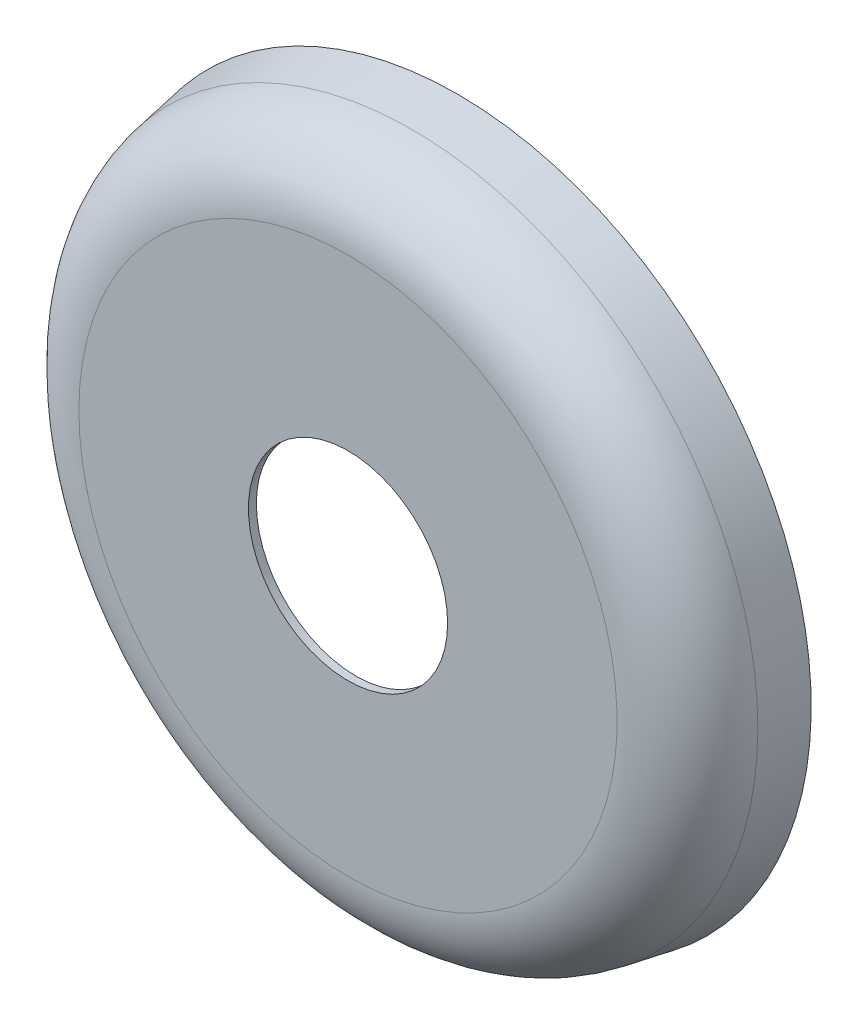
ISO-10303-21;
HEADER;
FILE_DESCRIPTION(('STEP AP214'),'2;1');
FILE_NAME('part.step','',(''),(''),'','','');
FILE_SCHEMA(('AUTOMOTIVE_DESIGN { 1 0 10303 214 1 1 1 1 }'));
ENDSEC;
DATA;
#1=APPLICATION_CONTEXT('core data for automotive mechanical design processes');
#2=APPLICATION_PROTOCOL_DEFINITION('international standard','automotive_design',2000,#1);
#3=PRODUCT_CONTEXT('',#1,'mechanical');
#4=PRODUCT('Part','Part','',(#3));
#5=PRODUCT_RELATED_PRODUCT_CATEGORY('part','',(#4));
#6=PRODUCT_DEFINITION_FORMATION('','',#4);
#7=PRODUCT_DEFINITION_CONTEXT('part definition',#1,'design');
#8=PRODUCT_DEFINITION('design','',#6,#7);
#9=PRODUCT_DEFINITION_SHAPE('','',#8);
#10=(LENGTH_UNIT() NAMED_UNIT(*) SI_UNIT(.MILLI.,.METRE.));
#11=(NAMED_UNIT(*) PLANE_ANGLE_UNIT() SI_UNIT($,.RADIAN.));
#12=(NAMED_UNIT(*) SI_UNIT($,.STERADIAN.) SOLID_ANGLE_UNIT());
#13=UNCERTAINTY_MEASURE_WITH_UNIT(LENGTH_MEASURE(1.E-05),#10,'distance_accuracy_value','');
#14=(GEOMETRIC_REPRESENTATION_CONTEXT(3) GLOBAL_UNCERTAINTY_ASSIGNED_CONTEXT((#13)) GLOBAL_UNIT_ASSIGNED_CONTEXT((#10,
#11,#12)) REPRESENTATION_CONTEXT('',''));
#15=CARTESIAN_POINT('',(0.,0.,0.));
#16=DIRECTION('',(0.,0.,1.));
#17=DIRECTION('',(1.,0.,0.));
#18=AXIS2_PLACEMENT_3D('',#15,#16,#17);
#19=CARTESIAN_POINT('',(0.,0.,13.6));
#20=DIRECTION('',(0.,0.,-1.));
#21=DIRECTION('',(-1.,0.,0.));
#22=AXIS2_PLACEMENT_3D('',#19,#20,#21);
#23=PLANE('',#22);
#24=CARTESIAN_POINT('',(0.,0.,13.6));
#25=DIRECTION('',(0.,0.,1.));
#26=DIRECTION('',(1.,0.,0.));
#27=AXIS2_PLACEMENT_3D('',#24,#25,#26);
#28=CIRCLE('',#27,10.);
#29=CARTESIAN_POINT('',(10.,0.,13.6));
#30=VERTEX_POINT('',#29);
#31=EDGE_CURVE('E80',#30,#30,#28,.T.);
#32=ORIENTED_EDGE('',*,*,#31,.F.);
#33=EDGE_LOOP('',(#32));
#34=FACE_BOUND('',#33,.T.);
#35=CARTESIAN_POINT('',(0.,0.,13.6));
#36=DIRECTION('',(0.,0.,-1.));
#37=DIRECTION('',(-1.,0.,0.));
#38=AXIS2_PLACEMENT_3D('',#35,#36,#37);
#39=CIRCLE('',#38,27.0150228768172);
#40=CARTESIAN_POINT('',(-27.0150228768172,0.,13.6));
#41=VERTEX_POINT('',#40);
#42=EDGE_CURVE('E10',#41,#41,#39,.F.);
#43=ORIENTED_EDGE('',*,*,#42,.T.);
#44=EDGE_LOOP('',(#43));
#45=FACE_BOUND('',#44,.T.);
#46=ADVANCED_FACE('F55',(#34,#45),#23,.F.);
#47=CARTESIAN_POINT('',(0.,0.,12.8));
#48=DIRECTION('',(0.,0.,-1.));
#49=DIRECTION('',(-1.,0.,0.));
#50=AXIS2_PLACEMENT_3D('',#47,#48,#49);
#51=PLANE('',#50);
#52=CARTESIAN_POINT('',(0.,0.,12.8));
#53=DIRECTION('',(0.,0.,-1.));
#54=DIRECTION('',(-1.,0.,0.));
#55=AXIS2_PLACEMENT_3D('',#52,#53,#54);
#56=CIRCLE('',#55,10.);
#57=CARTESIAN_POINT('',(-10.,0.,12.8));
#58=VERTEX_POINT('',#57);
#59=EDGE_CURVE('E59',#58,#58,#56,.T.);
#60=ORIENTED_EDGE('',*,*,#59,.F.);
#61=EDGE_LOOP('',(#60));
#62=FACE_BOUND('',#61,.T.);
#63=CARTESIAN_POINT('',(0.,0.,12.8));
#64=DIRECTION('',(0.,0.,-1.));
#65=DIRECTION('',(-1.,0.,0.));
#66=AXIS2_PLACEMENT_3D('',#63,#64,#65);
#67=CIRCLE('',#66,27.0150228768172);
#68=CARTESIAN_POINT('',(-27.0150228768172,0.,12.8));
#69=VERTEX_POINT('',#68);
#70=EDGE_CURVE('E77',#69,#69,#67,.T.);
#71=ORIENTED_EDGE('',*,*,#70,.T.);
#72=EDGE_LOOP('',(#71));
#73=FACE_BOUND('',#72,.T.);
#74=ADVANCED_FACE('F101',(#62,#73),#51,.T.);
#75=CARTESIAN_POINT('',(0.,0.,5.8));
#76=DIRECTION('',(0.,0.,-1.));
#77=DIRECTION('',(-1.,0.,0.));
#78=AXIS2_PLACEMENT_3D('',#75,#76,#77);
#79=TOROIDAL_SURFACE('',#78,27.0150228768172,7.8);
#80=ORIENTED_EDGE('',*,*,#42,.F.);
#81=EDGE_LOOP('',(#80));
#82=FACE_BOUND('',#81,.T.);
#83=CARTESIAN_POINT('',(0.,0.,7.15445578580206));
#84=DIRECTION('',(0.,0.,-1.));
#85=DIRECTION('',(-1.,0.,0.));
#86=AXIS2_PLACEMENT_3D('',#83,#84,#85);
#87=CIRCLE('',#86,34.6965233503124);
#88=CARTESIAN_POINT('',(-34.6965233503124,0.,7.15445578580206));
#89=VERTEX_POINT('',#88);
#90=EDGE_CURVE('E63',#89,#89,#87,.T.);
#91=ORIENTED_EDGE('',*,*,#90,.F.);
#92=EDGE_LOOP('',(#91));
#93=FACE_BOUND('',#92,.T.);
#94=ADVANCED_FACE('F57',(#82,#93),#79,.T.);
#95=CARTESIAN_POINT('',(0.,0.,13.6));
#96=DIRECTION('',(0.,0.,-1.));
#97=DIRECTION('',(-1.,0.,0.));
#98=AXIS2_PLACEMENT_3D('',#95,#96,#97);
#99=CONICAL_SURFACE('',#98,33.56,0.174532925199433);
#100=ORIENTED_EDGE('',*,*,#90,.T.);
#101=EDGE_LOOP('',(#100));
#102=FACE_BOUND('',#101,.T.);
#103=CARTESIAN_POINT('',(0.,0.,2.6));
#104=DIRECTION('',(0.,0.,-1.));
#105=DIRECTION('',(0.,1.,0.));
#106=AXIS2_PLACEMENT_3D('',#103,#104,#105);
#107=CIRCLE('',#106,35.4995967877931);
#108=CARTESIAN_POINT('',(0.,35.4995967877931,2.6));
#109=VERTEX_POINT('',#108);
#110=EDGE_CURVE('E71',#109,#109,#107,.F.);
#111=ORIENTED_EDGE('',*,*,#110,.T.);
#112=EDGE_LOOP('',(#111));
#113=FACE_BOUND('',#112,.T.);
#114=ADVANCED_FACE('F109',(#102,#113),#99,.T.);
#115=CARTESIAN_POINT('',(110.,67.4448979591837,2.6));
#116=DIRECTION('',(0.,0.,-1.));
#117=DIRECTION('',(0.,1.,0.));
#118=AXIS2_PLACEMENT_3D('',#115,#116,#117);
#119=PLANE('',#118);
#120=ORIENTED_EDGE('',*,*,#110,.F.);
#121=EDGE_LOOP('',(#120));
#122=FACE_BOUND('',#121,.T.);
#123=CARTESIAN_POINT('',(0.,0.,2.6));
#124=DIRECTION('',(0.,0.,-1.));
#125=DIRECTION('',(0.,1.,0.));
#126=AXIS2_PLACEMENT_3D('',#123,#124,#125);
#127=CIRCLE('',#126,34.6872554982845);
#128=CARTESIAN_POINT('',(0.,34.6872554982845,2.6));
#129=VERTEX_POINT('',#128);
#130=EDGE_CURVE('E73',#129,#129,#127,.F.);
#131=ORIENTED_EDGE('',*,*,#130,.T.);
#132=EDGE_LOOP('',(#131));
#133=FACE_BOUND('',#132,.T.);
#134=ADVANCED_FACE('F117',(#122,#133),#119,.T.);
#135=CARTESIAN_POINT('',(0.,0.,13.4610814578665));
#136=DIRECTION('',(0.,0.,-1.));
#137=DIRECTION('',(-1.,0.,0.));
#138=AXIS2_PLACEMENT_3D('',#135,#136,#137);
#139=CONICAL_SURFACE('',#138,32.7721537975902,0.174532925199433);
#140=CARTESIAN_POINT('',(0.,0.,7.01553724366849));
#141=DIRECTION('',(0.,0.,1.));
#142=DIRECTION('',(1.,0.,0.));
#143=AXIS2_PLACEMENT_3D('',#140,#141,#142);
#144=CIRCLE('',#143,33.9086771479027);
#145=CARTESIAN_POINT('',(33.9086771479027,0.,7.01553724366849));
#146=VERTEX_POINT('',#145);
#147=EDGE_CURVE('E68',#146,#146,#144,.T.);
#148=ORIENTED_EDGE('',*,*,#147,.T.);
#149=EDGE_LOOP('',(#148));
#150=FACE_BOUND('',#149,.T.);
#151=ORIENTED_EDGE('',*,*,#130,.F.);
#152=EDGE_LOOP('',(#151));
#153=FACE_BOUND('',#152,.T.);
#154=ADVANCED_FACE('F92',(#150,#153),#139,.F.);
#155=CARTESIAN_POINT('',(0.,0.,5.8));
#156=DIRECTION('',(0.,0.,-1.));
#157=DIRECTION('',(-1.,0.,0.));
#158=AXIS2_PLACEMENT_3D('',#155,#156,#157);
#159=TOROIDAL_SURFACE('',#158,27.0150228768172,7.);
#160=ORIENTED_EDGE('',*,*,#147,.F.);
#161=EDGE_LOOP('',(#160));
#162=FACE_BOUND('',#161,.T.);
#163=ORIENTED_EDGE('',*,*,#70,.F.);
#164=EDGE_LOOP('',(#163));
#165=FACE_BOUND('',#164,.T.);
#166=ADVANCED_FACE('F95',(#162,#165),#159,.F.);
#167=CARTESIAN_POINT('',(0.,0.,2.6));
#168=DIRECTION('',(0.,0.,1.));
#169=DIRECTION('',(1.,0.,0.));
#170=AXIS2_PLACEMENT_3D('',#167,#168,#169);
#171=CYLINDRICAL_SURFACE('',#170,10.);
#172=ORIENTED_EDGE('',*,*,#59,.T.);
#173=EDGE_LOOP('',(#172));
#174=FACE_BOUND('',#173,.T.);
#175=ORIENTED_EDGE('',*,*,#31,.T.);
#176=EDGE_LOOP('',(#175));
#177=FACE_BOUND('',#176,.T.);
#178=ADVANCED_FACE('F98',(#174,#177),#171,.F.);
#179=CLOSED_SHELL('',(#46,#74,#94,#114,#134,#154,#166,#178));
#180=MANIFOLD_SOLID_BREP('B2',#179);
#181=ADVANCED_BREP_SHAPE_REPRESENTATION('',(#18,#180),#14);
#182=SHAPE_DEFINITION_REPRESENTATION(#9,#181);
ENDSEC;
END-ISO-10303-21;
